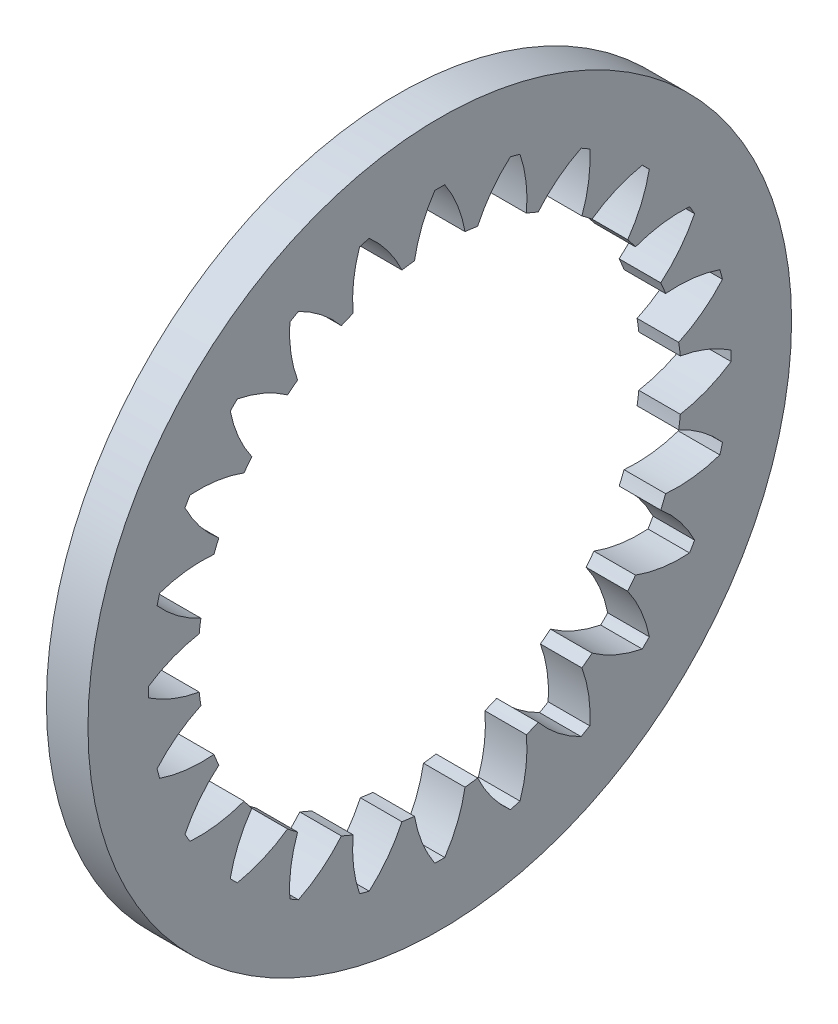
from build123d import *

# Parameters (mm, degrees)
BASPROSKE_W     = 12
BASPROSKE_H     = 31.75
TOOTHCUT_DEPTH  = 145.184326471
TEETHCUTS_COUNT = 24
TEETHCUTS_ANGLE = 345


with BuildPart() as part:
    # BasProSke → Base-Revolve (revolve)
    with BuildSketch(Plane(origin=(0, 0, 0), x_dir=(1, 0, 0), z_dir=(0, 1, 0)), mode=Mode.PRIVATE) as base_revolve_sk:
        with Locations((6, 85.725)):
            Rectangle(BASPROSKE_W, BASPROSKE_H)
    revolve(base_revolve_sk.sketch.rotate(Axis((-10, 0, 0), (1, 0, 0)), 180), axis=Axis((-10, 0, 0), (1, 0, 0)))

    # TooCutSke → ToothCut (cut, through all)
    with BuildSketch(Plane(origin=(0, 0, 0), x_dir=(0, 0, -1), z_dir=(1, 0, 0))):
        with BuildLine():
            ThreePointArc((7.294804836, 69.442498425), (5.138539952, 77.091294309), (1.442489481, 84.126403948))
            ThreePointArc((1.442489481, 84.126403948), (0, 84.13877), (-1.442489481, 84.126403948))
            ThreePointArc((-1.442489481, 84.126403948), (-5.138539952, 77.091294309), (-7.294804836, 69.442498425))
            ThreePointArc((-7.294804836, 69.442498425), (0, 69.8246), (7.294804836, 69.442498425))
        make_face()
    toothcut = extrude(amount=TOOTHCUT_DEPTH, mode=Mode.SUBTRACT)

    # TeethCuts: ToothCut ×24 about axis
    teethcuts_axis = Axis((-10, 0, 0), (1, 0, 0))
    for i in range(1, TEETHCUTS_COUNT):
        add(toothcut.rotate(teethcuts_axis, i * TEETHCUTS_ANGLE / (TEETHCUTS_COUNT - 1)), mode=Mode.SUBTRACT)


solid = part.part
